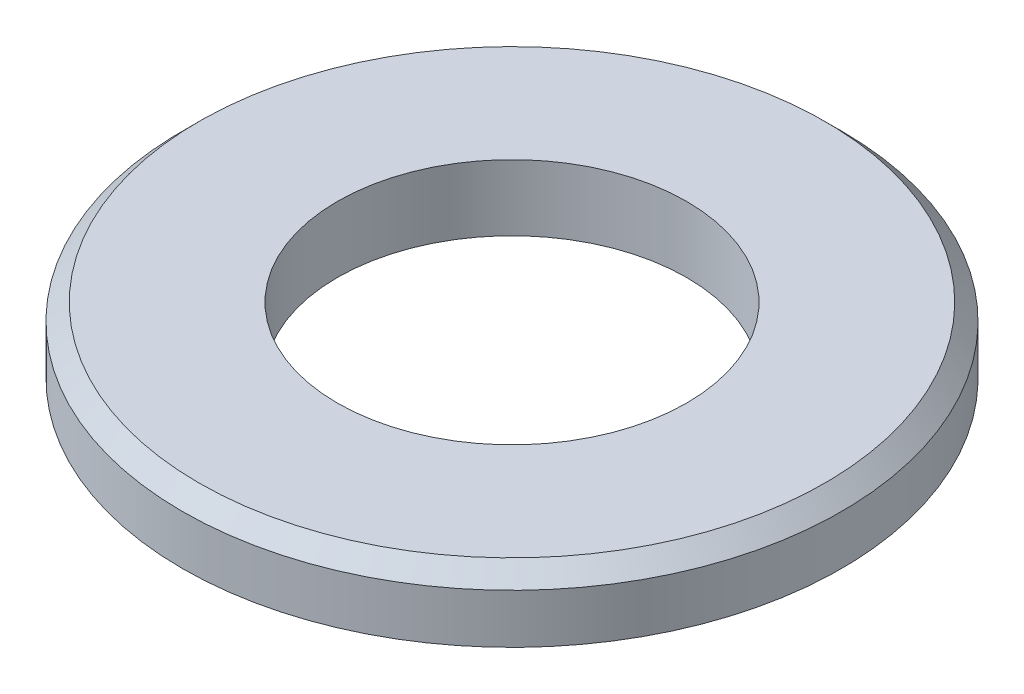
ISO-10303-21;
HEADER;
FILE_DESCRIPTION(('STEP AP214'),'2;1');
FILE_NAME('part.step','',(''),(''),'','','');
FILE_SCHEMA(('AUTOMOTIVE_DESIGN { 1 0 10303 214 1 1 1 1 }'));
ENDSEC;
DATA;
#1=APPLICATION_CONTEXT('core data for automotive mechanical design processes');
#2=APPLICATION_PROTOCOL_DEFINITION('international standard','automotive_design',2000,#1);
#3=PRODUCT_CONTEXT('',#1,'mechanical');
#4=PRODUCT('Part','Part','',(#3));
#5=PRODUCT_RELATED_PRODUCT_CATEGORY('part','',(#4));
#6=PRODUCT_DEFINITION_FORMATION('','',#4);
#7=PRODUCT_DEFINITION_CONTEXT('part definition',#1,'design');
#8=PRODUCT_DEFINITION('design','',#6,#7);
#9=PRODUCT_DEFINITION_SHAPE('','',#8);
#10=(LENGTH_UNIT() NAMED_UNIT(*) SI_UNIT(.MILLI.,.METRE.));
#11=(NAMED_UNIT(*) PLANE_ANGLE_UNIT() SI_UNIT($,.RADIAN.));
#12=(NAMED_UNIT(*) SI_UNIT($,.STERADIAN.) SOLID_ANGLE_UNIT());
#13=UNCERTAINTY_MEASURE_WITH_UNIT(LENGTH_MEASURE(1.E-05),#10,'distance_accuracy_value','');
#14=(GEOMETRIC_REPRESENTATION_CONTEXT(3) GLOBAL_UNCERTAINTY_ASSIGNED_CONTEXT((#13)) GLOBAL_UNIT_ASSIGNED_CONTEXT((#10,
#11,#12)) REPRESENTATION_CONTEXT('',''));
#15=CARTESIAN_POINT('',(0.,0.,0.));
#16=DIRECTION('',(0.,0.,1.));
#17=DIRECTION('',(1.,0.,0.));
#18=AXIS2_PLACEMENT_3D('',#15,#16,#17);
#19=CARTESIAN_POINT('',(0.,1.,0.));
#20=DIRECTION('',(0.,1.,0.));
#21=DIRECTION('',(0.,0.,1.));
#22=AXIS2_PLACEMENT_3D('',#19,#20,#21);
#23=PLANE('',#22);
#24=CARTESIAN_POINT('',(0.,1.,0.));
#25=DIRECTION('',(0.,1.,0.));
#26=DIRECTION('',(0.,0.,1.));
#27=AXIS2_PLACEMENT_3D('',#24,#25,#26);
#28=CIRCLE('',#27,4.75);
#29=CARTESIAN_POINT('',(0.,1.,4.75));
#30=VERTEX_POINT('',#29);
#31=EDGE_CURVE('E54',#30,#30,#28,.T.);
#32=ORIENTED_EDGE('',*,*,#31,.T.);
#33=EDGE_LOOP('',(#32));
#34=FACE_BOUND('',#33,.T.);
#35=CARTESIAN_POINT('',(0.,1.,0.));
#36=DIRECTION('',(0.,1.,0.));
#37=DIRECTION('',(0.,0.,1.));
#38=AXIS2_PLACEMENT_3D('',#35,#36,#37);
#39=CIRCLE('',#38,2.65);
#40=CARTESIAN_POINT('',(0.,1.,2.65));
#41=VERTEX_POINT('',#40);
#42=EDGE_CURVE('E66',#41,#41,#39,.T.);
#43=ORIENTED_EDGE('',*,*,#42,.F.);
#44=EDGE_LOOP('',(#43));
#45=FACE_BOUND('',#44,.T.);
#46=ADVANCED_FACE('F47',(#34,#45),#23,.T.);
#47=CARTESIAN_POINT('',(0.,0.,0.));
#48=DIRECTION('',(0.,1.,0.));
#49=DIRECTION('',(0.,0.,1.));
#50=AXIS2_PLACEMENT_3D('',#47,#48,#49);
#51=PLANE('',#50);
#52=CARTESIAN_POINT('',(0.,0.,0.));
#53=DIRECTION('',(0.,1.,0.));
#54=DIRECTION('',(0.,0.,1.));
#55=AXIS2_PLACEMENT_3D('',#52,#53,#54);
#56=CIRCLE('',#55,5.);
#57=CARTESIAN_POINT('',(0.,0.,5.));
#58=VERTEX_POINT('',#57);
#59=EDGE_CURVE('E59',#58,#58,#56,.T.);
#60=ORIENTED_EDGE('',*,*,#59,.F.);
#61=EDGE_LOOP('',(#60));
#62=FACE_BOUND('',#61,.T.);
#63=CARTESIAN_POINT('',(0.,0.,0.));
#64=DIRECTION('',(0.,1.,0.));
#65=DIRECTION('',(0.,0.,1.));
#66=AXIS2_PLACEMENT_3D('',#63,#64,#65);
#67=CIRCLE('',#66,2.65);
#68=CARTESIAN_POINT('',(0.,0.,2.65));
#69=VERTEX_POINT('',#68);
#70=EDGE_CURVE('E69',#69,#69,#67,.T.);
#71=ORIENTED_EDGE('',*,*,#70,.T.);
#72=EDGE_LOOP('',(#71));
#73=FACE_BOUND('',#72,.T.);
#74=ADVANCED_FACE('F82',(#62,#73),#51,.F.);
#75=CARTESIAN_POINT('',(0.,1.,0.));
#76=DIRECTION('',(0.,-1.,0.));
#77=DIRECTION('',(0.,0.,-1.));
#78=AXIS2_PLACEMENT_3D('',#75,#76,#77);
#79=CYLINDRICAL_SURFACE('',#78,5.);
#80=CARTESIAN_POINT('',(0.,0.749999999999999,0.));
#81=DIRECTION('',(0.,1.,0.));
#82=DIRECTION('',(0.,0.,1.));
#83=AXIS2_PLACEMENT_3D('',#80,#81,#82);
#84=CIRCLE('',#83,5.);
#85=CARTESIAN_POINT('',(0.,0.749999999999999,5.));
#86=VERTEX_POINT('',#85);
#87=EDGE_CURVE('E12',#86,#86,#84,.F.);
#88=ORIENTED_EDGE('',*,*,#87,.T.);
#89=EDGE_LOOP('',(#88));
#90=FACE_BOUND('',#89,.T.);
#91=ORIENTED_EDGE('',*,*,#59,.T.);
#92=EDGE_LOOP('',(#91));
#93=FACE_BOUND('',#92,.T.);
#94=ADVANCED_FACE('F87',(#90,#93),#79,.T.);
#95=CARTESIAN_POINT('',(0.,1.,0.));
#96=DIRECTION('',(0.,-1.,0.));
#97=DIRECTION('',(0.,0.,-1.));
#98=AXIS2_PLACEMENT_3D('',#95,#96,#97);
#99=CYLINDRICAL_SURFACE('',#98,2.65);
#100=ORIENTED_EDGE('',*,*,#42,.T.);
#101=EDGE_LOOP('',(#100));
#102=FACE_BOUND('',#101,.T.);
#103=ORIENTED_EDGE('',*,*,#70,.F.);
#104=EDGE_LOOP('',(#103));
#105=FACE_BOUND('',#104,.T.);
#106=ADVANCED_FACE('F78',(#102,#105),#99,.F.);
#107=CARTESIAN_POINT('',(0.,1.,0.));
#108=DIRECTION('',(0.,-1.,0.));
#109=DIRECTION('',(0.,0.,-1.));
#110=AXIS2_PLACEMENT_3D('',#107,#108,#109);
#111=CONICAL_SURFACE('',#110,4.75,0.785398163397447);
#112=ORIENTED_EDGE('',*,*,#87,.F.);
#113=EDGE_LOOP('',(#112));
#114=FACE_BOUND('',#113,.T.);
#115=ORIENTED_EDGE('',*,*,#31,.F.);
#116=EDGE_LOOP('',(#115));
#117=FACE_BOUND('',#116,.T.);
#118=ADVANCED_FACE('F49',(#114,#117),#111,.T.);
#119=CLOSED_SHELL('',(#46,#74,#94,#106,#118));
#120=MANIFOLD_SOLID_BREP('B2',#119);
#121=ADVANCED_BREP_SHAPE_REPRESENTATION('',(#18,#120),#14);
#122=SHAPE_DEFINITION_REPRESENTATION(#9,#121);
ENDSEC;
END-ISO-10303-21;
